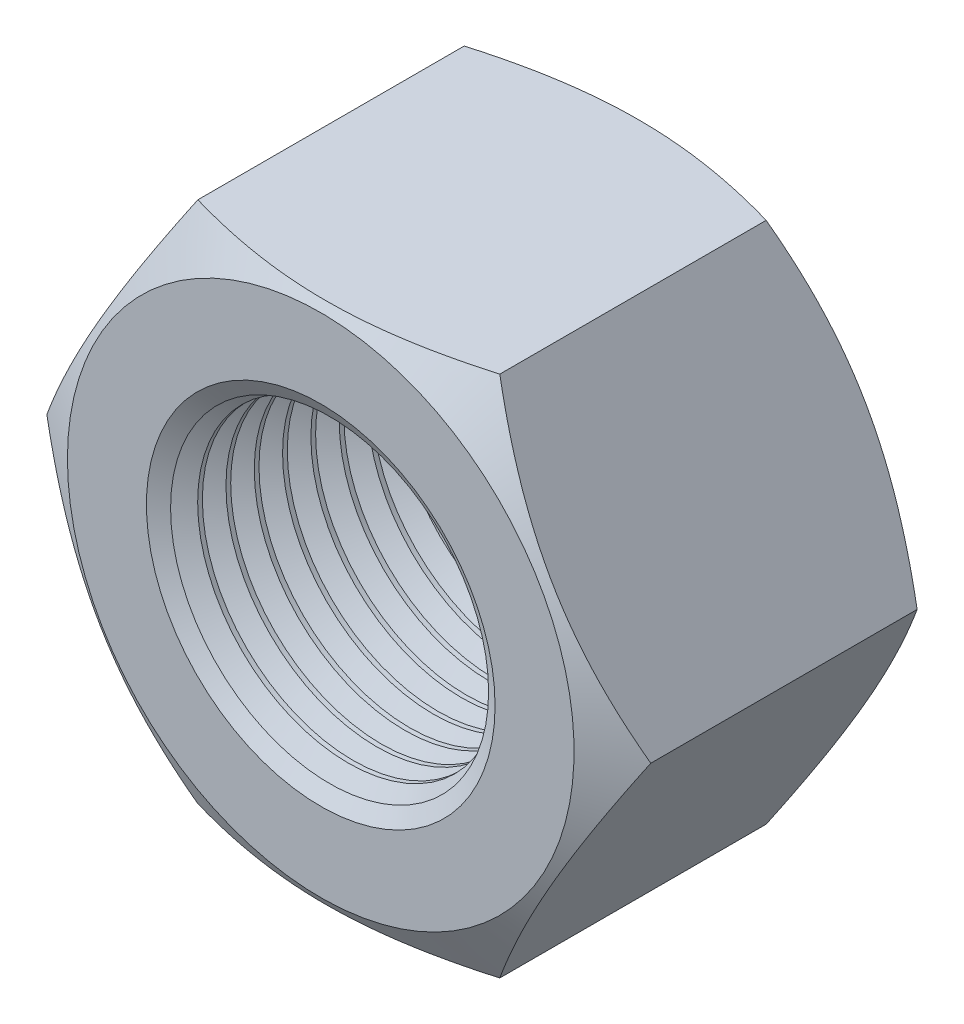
from build123d import *
from OCP.BRepFilletAPI import BRepFilletAPI_MakeChamfer

# Parameters (mm, degrees)
SKETCH1_R        = 6.9175
BASENUT_DEPTH    = 14.8
ENDCHAMFER_SIZE  = 1.0825
ENDCHAMFER_SIZE2 = 0.624981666
LPATTERN10_COUNT = 11
LPATTERN10_PITCH = 1.299


with BuildPart() as part:
    # Sketch1 → BaseNut (new body)
    with BuildSketch(Plane.XY):
        Polygon((13.856406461, 0), (6.92820323, 12), (-6.92820323, 12), (-13.856406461, 0), (-6.92820323, -12), (6.92820323, -12), align=None)
        Circle(SKETCH1_R, mode=Mode.SUBTRACT)
    extrude(amount=-BASENUT_DEPTH)

    # Sketch2 → Double-Chamfer (revolve, cut)
    with BuildSketch(Plane(origin=(0, 0, 0), x_dir=(1, 0, 0), z_dir=(0, 1, 0))):
        Polygon((-13.856406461, 14.8), (-11.625, 14.8), (-13.856406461, 13.511696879), align=None)
        Polygon((-13.856406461, 1.288303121), (-13.856406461, 0), (-11.625, 0), align=None)
    revolve(axis=Axis((0, 0, -3.375940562), (0, 0, 1)), mode=Mode.SUBTRACT)

    # EndChamfer: one chamfer whose edges measure the first distance from different faces: ONE call of the kernel's chamfer builder (chamfer() names one face for all edges)
    endchamfer_edges_1 = [part.edges().sort_by_distance(p)[0] for p in [
        (-6.9175, 0, -14.8),
    ]]
    endchamfer_side_1 = [part.faces().sort_by_distance(p)[0] for p in [
        (-6.9175, 0, -7.4),
    ]]
    endchamfer_edges_2 = [part.edges().sort_by_distance(p)[0] for p in [
        (-6.9175, 0, 0),
    ]]
    endchamfer_side_2 = [part.faces().sort_by_distance(p)[0] for p in [
        (11.296195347, 0, 0),
    ]]
    endchamfer = BRepFilletAPI_MakeChamfer(part.part.solid().wrapped)
    for e in endchamfer_edges_1:
        endchamfer.Add(ENDCHAMFER_SIZE, ENDCHAMFER_SIZE2, e.wrapped, endchamfer_side_1[0].wrapped)  # the first distance lies on this face
    for e in endchamfer_edges_2:
        endchamfer.Add(ENDCHAMFER_SIZE, ENDCHAMFER_SIZE2, e.wrapped, endchamfer_side_2[0].wrapped)  # the first distance lies on this face
    add(Compound.cast(endchamfer.Shape()), mode=Mode.REPLACE)

    # Sketch3 → Cut-Revolve10 (revolve, cut)
    with BuildSketch(Plane(origin=(0, 0, 0), x_dir=(1, 0, 0), z_dir=(0, 1, 0)), mode=Mode.PRIVATE) as cut_revolve10_sk:
        Polygon((-7.8549725, 13.7175), (-6.9175, 13.17625), (-5.835, 13.17625), (-5.835, 14.25875), (-6.9175, 14.25875), align=None)
    cut_revolve10 = revolve(cut_revolve10_sk.sketch.rotate(Axis((0, 0, -7.438254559), (0, 0, -1)), 180), axis=Axis((0, 0, -7.438254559), (0, 0, -1)), mode=Mode.SUBTRACT)

    # LPattern10: Cut-Revolve10 ×11
    with Locations(*[(0, 0, i * LPATTERN10_PITCH) for i in range(1, LPATTERN10_COUNT)]):
        add(cut_revolve10, mode=Mode.SUBTRACT)


solid = part.part
